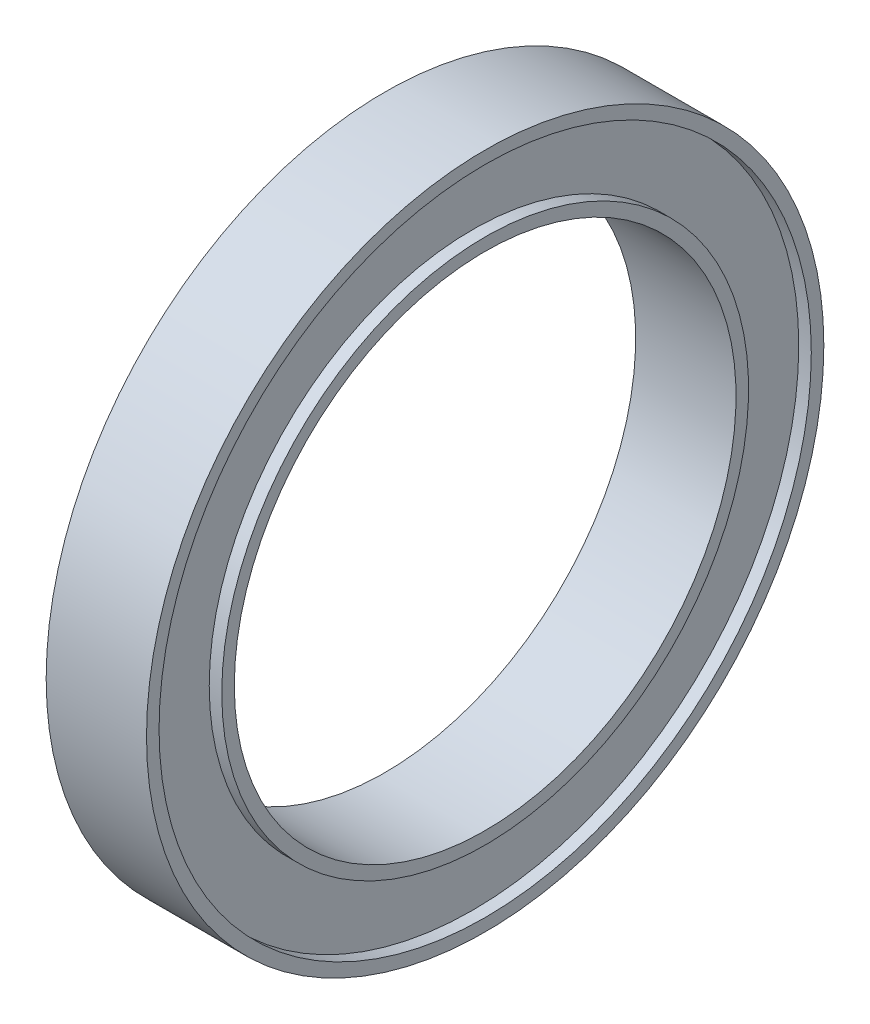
ISO-10303-21;
HEADER;
FILE_DESCRIPTION(('STEP AP214'),'2;1');
FILE_NAME('part.step','',(''),(''),'','','');
FILE_SCHEMA(('AUTOMOTIVE_DESIGN { 1 0 10303 214 1 1 1 1 }'));
ENDSEC;
DATA;
#1=APPLICATION_CONTEXT('core data for automotive mechanical design processes');
#2=APPLICATION_PROTOCOL_DEFINITION('international standard','automotive_design',2000,#1);
#3=PRODUCT_CONTEXT('',#1,'mechanical');
#4=PRODUCT('Part','Part','',(#3));
#5=PRODUCT_RELATED_PRODUCT_CATEGORY('part','',(#4));
#6=PRODUCT_DEFINITION_FORMATION('','',#4);
#7=PRODUCT_DEFINITION_CONTEXT('part definition',#1,'design');
#8=PRODUCT_DEFINITION('design','',#6,#7);
#9=PRODUCT_DEFINITION_SHAPE('','',#8);
#10=(LENGTH_UNIT() NAMED_UNIT(*) SI_UNIT(.MILLI.,.METRE.));
#11=(NAMED_UNIT(*) PLANE_ANGLE_UNIT() SI_UNIT($,.RADIAN.));
#12=(NAMED_UNIT(*) SI_UNIT($,.STERADIAN.) SOLID_ANGLE_UNIT());
#13=UNCERTAINTY_MEASURE_WITH_UNIT(LENGTH_MEASURE(1.E-05),#10,'distance_accuracy_value','');
#14=(GEOMETRIC_REPRESENTATION_CONTEXT(3) GLOBAL_UNCERTAINTY_ASSIGNED_CONTEXT((#13)) GLOBAL_UNIT_ASSIGNED_CONTEXT((#10,
#11,#12)) REPRESENTATION_CONTEXT('',''));
#15=CARTESIAN_POINT('',(0.,0.,0.));
#16=DIRECTION('',(0.,0.,1.));
#17=DIRECTION('',(1.,0.,0.));
#18=AXIS2_PLACEMENT_3D('',#15,#16,#17);
#19=CARTESIAN_POINT('',(2.,0.,0.));
#20=DIRECTION('',(1.,0.,0.));
#21=DIRECTION('',(0.,0.,-1.));
#22=AXIS2_PLACEMENT_3D('',#19,#20,#21);
#23=PLANE('',#22);
#24=CARTESIAN_POINT('',(2.,0.,0.));
#25=DIRECTION('',(-1.,0.,0.));
#26=DIRECTION('',(0.,0.,1.));
#27=AXIS2_PLACEMENT_3D('',#24,#25,#26);
#28=CIRCLE('',#27,10.);
#29=CARTESIAN_POINT('',(2.,0.,10.));
#30=VERTEX_POINT('',#29);
#31=EDGE_CURVE('E44',#30,#30,#28,.T.);
#32=ORIENTED_EDGE('',*,*,#31,.T.);
#33=EDGE_LOOP('',(#32));
#34=FACE_BOUND('',#33,.T.);
#35=CARTESIAN_POINT('',(2.,0.,0.));
#36=DIRECTION('',(-1.,0.,0.));
#37=DIRECTION('',(0.,0.,1.));
#38=AXIS2_PLACEMENT_3D('',#35,#36,#37);
#39=CIRCLE('',#38,10.5);
#40=CARTESIAN_POINT('',(2.,0.,10.5));
#41=VERTEX_POINT('',#40);
#42=EDGE_CURVE('E70',#41,#41,#39,.T.);
#43=ORIENTED_EDGE('',*,*,#42,.F.);
#44=EDGE_LOOP('',(#43));
#45=FACE_BOUND('',#44,.T.);
#46=ADVANCED_FACE('F33',(#34,#45),#23,.T.);
#47=CARTESIAN_POINT('',(-2.,0.,0.));
#48=DIRECTION('',(1.,0.,0.));
#49=DIRECTION('',(0.,0.,-1.));
#50=AXIS2_PLACEMENT_3D('',#47,#48,#49);
#51=PLANE('',#50);
#52=CARTESIAN_POINT('',(-2.,0.,0.));
#53=DIRECTION('',(-1.,0.,0.));
#54=DIRECTION('',(0.,0.,1.));
#55=AXIS2_PLACEMENT_3D('',#52,#53,#54);
#56=CIRCLE('',#55,10.);
#57=CARTESIAN_POINT('',(-2.,0.,10.));
#58=VERTEX_POINT('',#57);
#59=EDGE_CURVE('E46',#58,#58,#56,.T.);
#60=ORIENTED_EDGE('',*,*,#59,.F.);
#61=EDGE_LOOP('',(#60));
#62=FACE_BOUND('',#61,.T.);
#63=CARTESIAN_POINT('',(-2.,0.,0.));
#64=DIRECTION('',(-1.,0.,0.));
#65=DIRECTION('',(0.,0.,1.));
#66=AXIS2_PLACEMENT_3D('',#63,#64,#65);
#67=CIRCLE('',#66,10.5);
#68=CARTESIAN_POINT('',(-2.,0.,10.5));
#69=VERTEX_POINT('',#68);
#70=EDGE_CURVE('E58',#69,#69,#67,.T.);
#71=ORIENTED_EDGE('',*,*,#70,.T.);
#72=EDGE_LOOP('',(#71));
#73=FACE_BOUND('',#72,.T.);
#74=ADVANCED_FACE('F86',(#62,#73),#51,.F.);
#75=CARTESIAN_POINT('',(2.,0.,0.));
#76=DIRECTION('',(-1.,0.,0.));
#77=DIRECTION('',(0.,0.,1.));
#78=AXIS2_PLACEMENT_3D('',#75,#76,#77);
#79=CYLINDRICAL_SURFACE('',#78,13.5);
#80=CARTESIAN_POINT('',(2.,0.,0.));
#81=DIRECTION('',(1.,0.,0.));
#82=DIRECTION('',(0.,0.,-1.));
#83=AXIS2_PLACEMENT_3D('',#80,#81,#82);
#84=CIRCLE('',#83,13.5);
#85=CARTESIAN_POINT('',(2.,0.,-13.5));
#86=VERTEX_POINT('',#85);
#87=EDGE_CURVE('E10',#86,#86,#84,.T.);
#88=ORIENTED_EDGE('',*,*,#87,.F.);
#89=EDGE_LOOP('',(#88));
#90=FACE_BOUND('',#89,.T.);
#91=CARTESIAN_POINT('',(-2.,0.,0.));
#92=DIRECTION('',(1.,0.,0.));
#93=DIRECTION('',(0.,0.,-1.));
#94=AXIS2_PLACEMENT_3D('',#91,#92,#93);
#95=CIRCLE('',#94,13.5);
#96=CARTESIAN_POINT('',(-2.,0.,-13.5));
#97=VERTEX_POINT('',#96);
#98=EDGE_CURVE('E37',#97,#97,#95,.T.);
#99=ORIENTED_EDGE('',*,*,#98,.T.);
#100=EDGE_LOOP('',(#99));
#101=FACE_BOUND('',#100,.T.);
#102=ADVANCED_FACE('F35',(#90,#101),#79,.T.);
#103=CARTESIAN_POINT('',(2.,0.,0.));
#104=DIRECTION('',(-1.,0.,0.));
#105=DIRECTION('',(0.,0.,1.));
#106=AXIS2_PLACEMENT_3D('',#103,#104,#105);
#107=CIRCLE('',#106,13.);
#108=CARTESIAN_POINT('',(2.,0.,13.));
#109=VERTEX_POINT('',#108);
#110=EDGE_CURVE('E64',#109,#109,#107,.T.);
#111=ORIENTED_EDGE('',*,*,#110,.T.);
#112=EDGE_LOOP('',(#111));
#113=FACE_BOUND('',#112,.T.);
#114=ORIENTED_EDGE('',*,*,#87,.T.);
#115=EDGE_LOOP('',(#114));
#116=FACE_BOUND('',#115,.T.);
#117=ADVANCED_FACE('F89',(#113,#116),#23,.T.);
#118=CARTESIAN_POINT('',(-2.,0.,0.));
#119=DIRECTION('',(-1.,0.,0.));
#120=DIRECTION('',(0.,0.,1.));
#121=AXIS2_PLACEMENT_3D('',#118,#119,#120);
#122=CIRCLE('',#121,13.);
#123=CARTESIAN_POINT('',(-2.,0.,13.));
#124=VERTEX_POINT('',#123);
#125=EDGE_CURVE('E52',#124,#124,#122,.T.);
#126=ORIENTED_EDGE('',*,*,#125,.F.);
#127=EDGE_LOOP('',(#126));
#128=FACE_BOUND('',#127,.T.);
#129=ORIENTED_EDGE('',*,*,#98,.F.);
#130=EDGE_LOOP('',(#129));
#131=FACE_BOUND('',#130,.T.);
#132=ADVANCED_FACE('F94',(#128,#131),#51,.F.);
#133=CARTESIAN_POINT('',(2.,0.,0.));
#134=DIRECTION('',(-1.,0.,0.));
#135=DIRECTION('',(0.,0.,1.));
#136=AXIS2_PLACEMENT_3D('',#133,#134,#135);
#137=CYLINDRICAL_SURFACE('',#136,10.);
#138=ORIENTED_EDGE('',*,*,#31,.F.);
#139=EDGE_LOOP('',(#138));
#140=FACE_BOUND('',#139,.T.);
#141=ORIENTED_EDGE('',*,*,#59,.T.);
#142=EDGE_LOOP('',(#141));
#143=FACE_BOUND('',#142,.T.);
#144=ADVANCED_FACE('F102',(#140,#143),#137,.F.);
#145=CARTESIAN_POINT('',(-1.5,0.,0.));
#146=DIRECTION('',(-1.,0.,0.));
#147=DIRECTION('',(0.,0.,1.));
#148=AXIS2_PLACEMENT_3D('',#145,#146,#147);
#149=CYLINDRICAL_SURFACE('',#148,13.);
#150=CARTESIAN_POINT('',(-1.5,0.,0.));
#151=DIRECTION('',(-1.,0.,0.));
#152=DIRECTION('',(0.,0.,1.));
#153=AXIS2_PLACEMENT_3D('',#150,#151,#152);
#154=CIRCLE('',#153,13.);
#155=CARTESIAN_POINT('',(-1.5,0.,13.));
#156=VERTEX_POINT('',#155);
#157=EDGE_CURVE('E49',#156,#156,#154,.T.);
#158=ORIENTED_EDGE('',*,*,#157,.F.);
#159=EDGE_LOOP('',(#158));
#160=FACE_BOUND('',#159,.T.);
#161=ORIENTED_EDGE('',*,*,#125,.T.);
#162=EDGE_LOOP('',(#161));
#163=FACE_BOUND('',#162,.T.);
#164=ADVANCED_FACE('F123',(#160,#163),#149,.F.);
#165=CARTESIAN_POINT('',(-1.5,0.,0.));
#166=DIRECTION('',(-1.,0.,0.));
#167=DIRECTION('',(0.,0.,1.));
#168=AXIS2_PLACEMENT_3D('',#165,#166,#167);
#169=PLANE('',#168);
#170=CARTESIAN_POINT('',(-1.5,0.,0.));
#171=DIRECTION('',(-1.,0.,0.));
#172=DIRECTION('',(0.,0.,1.));
#173=AXIS2_PLACEMENT_3D('',#170,#171,#172);
#174=CIRCLE('',#173,10.5);
#175=CARTESIAN_POINT('',(-1.5,0.,10.5));
#176=VERTEX_POINT('',#175);
#177=EDGE_CURVE('E55',#176,#176,#174,.T.);
#178=ORIENTED_EDGE('',*,*,#177,.F.);
#179=EDGE_LOOP('',(#178));
#180=FACE_BOUND('',#179,.T.);
#181=ORIENTED_EDGE('',*,*,#157,.T.);
#182=EDGE_LOOP('',(#181));
#183=FACE_BOUND('',#182,.T.);
#184=ADVANCED_FACE('F119',(#180,#183),#169,.T.);
#185=CARTESIAN_POINT('',(-1.5,0.,0.));
#186=DIRECTION('',(-1.,0.,0.));
#187=DIRECTION('',(0.,0.,1.));
#188=AXIS2_PLACEMENT_3D('',#185,#186,#187);
#189=CYLINDRICAL_SURFACE('',#188,10.5);
#190=ORIENTED_EDGE('',*,*,#177,.T.);
#191=EDGE_LOOP('',(#190));
#192=FACE_BOUND('',#191,.T.);
#193=ORIENTED_EDGE('',*,*,#70,.F.);
#194=EDGE_LOOP('',(#193));
#195=FACE_BOUND('',#194,.T.);
#196=ADVANCED_FACE('F113',(#192,#195),#189,.T.);
#197=CARTESIAN_POINT('',(1.5,0.,0.));
#198=DIRECTION('',(1.,0.,0.));
#199=DIRECTION('',(0.,0.,1.));
#200=AXIS2_PLACEMENT_3D('',#197,#198,#199);
#201=PLANE('',#200);
#202=CARTESIAN_POINT('',(1.5,0.,0.));
#203=DIRECTION('',(-1.,0.,0.));
#204=DIRECTION('',(0.,0.,1.));
#205=AXIS2_PLACEMENT_3D('',#202,#203,#204);
#206=CIRCLE('',#205,13.);
#207=CARTESIAN_POINT('',(1.5,0.,13.));
#208=VERTEX_POINT('',#207);
#209=EDGE_CURVE('E61',#208,#208,#206,.T.);
#210=ORIENTED_EDGE('',*,*,#209,.F.);
#211=EDGE_LOOP('',(#210));
#212=FACE_BOUND('',#211,.T.);
#213=CARTESIAN_POINT('',(1.5,0.,0.));
#214=DIRECTION('',(-1.,0.,0.));
#215=DIRECTION('',(0.,0.,1.));
#216=AXIS2_PLACEMENT_3D('',#213,#214,#215);
#217=CIRCLE('',#216,10.5);
#218=CARTESIAN_POINT('',(1.5,0.,10.5));
#219=VERTEX_POINT('',#218);
#220=EDGE_CURVE('E67',#219,#219,#217,.T.);
#221=ORIENTED_EDGE('',*,*,#220,.T.);
#222=EDGE_LOOP('',(#221));
#223=FACE_BOUND('',#222,.T.);
#224=ADVANCED_FACE('F76',(#212,#223),#201,.T.);
#225=CARTESIAN_POINT('',(1.5,0.,0.));
#226=DIRECTION('',(1.,0.,0.));
#227=DIRECTION('',(0.,0.,-1.));
#228=AXIS2_PLACEMENT_3D('',#225,#226,#227);
#229=CYLINDRICAL_SURFACE('',#228,13.);
#230=ORIENTED_EDGE('',*,*,#209,.T.);
#231=EDGE_LOOP('',(#230));
#232=FACE_BOUND('',#231,.T.);
#233=ORIENTED_EDGE('',*,*,#110,.F.);
#234=EDGE_LOOP('',(#233));
#235=FACE_BOUND('',#234,.T.);
#236=ADVANCED_FACE('F81',(#232,#235),#229,.F.);
#237=CARTESIAN_POINT('',(1.5,0.,0.));
#238=DIRECTION('',(1.,0.,0.));
#239=DIRECTION('',(0.,0.,-1.));
#240=AXIS2_PLACEMENT_3D('',#237,#238,#239);
#241=CYLINDRICAL_SURFACE('',#240,10.5);
#242=ORIENTED_EDGE('',*,*,#220,.F.);
#243=EDGE_LOOP('',(#242));
#244=FACE_BOUND('',#243,.T.);
#245=ORIENTED_EDGE('',*,*,#42,.T.);
#246=EDGE_LOOP('',(#245));
#247=FACE_BOUND('',#246,.T.);
#248=ADVANCED_FACE('F78',(#244,#247),#241,.T.);
#249=CLOSED_SHELL('',(#46,#74,#102,#117,#132,#144,#164,#184,#196,#224,#236,#248));
#250=MANIFOLD_SOLID_BREP('B2',#249);
#251=ADVANCED_BREP_SHAPE_REPRESENTATION('',(#18,#250),#14);
#252=SHAPE_DEFINITION_REPRESENTATION(#9,#251);
ENDSEC;
END-ISO-10303-21;
